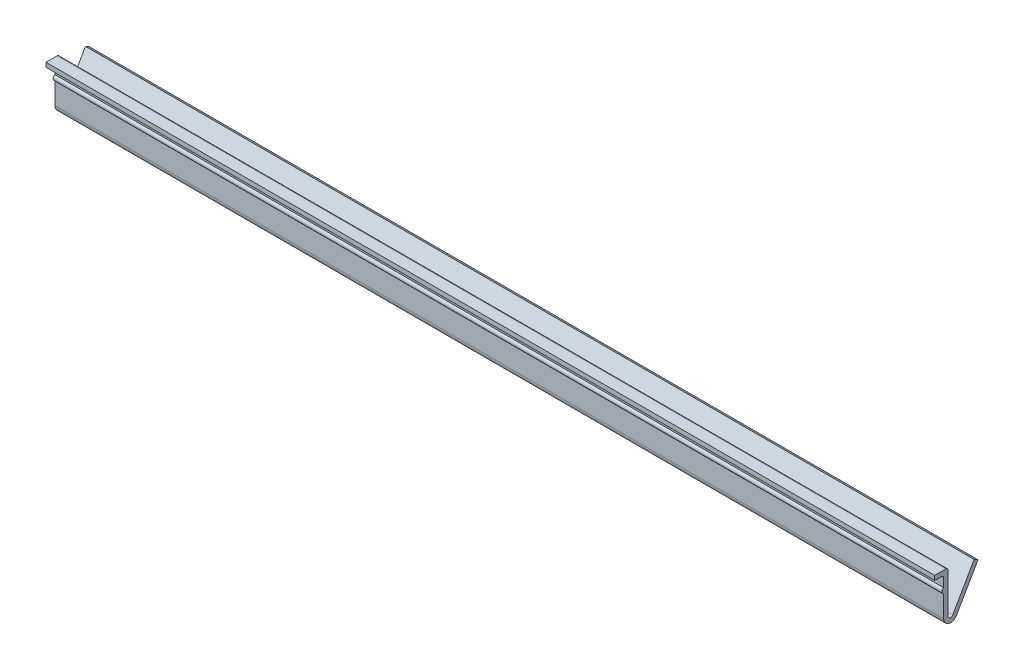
from build123d import *

# Parameters (mm, degrees)
ASENNUSLISTAT_1_6001_ASENNUSLISTA_30_1_DEPTH = 200


with BuildPart() as part:
    # Sketch1 → Asennuslistat 1.6001 ASENNUSLISTA 30_1 (new body)
    with BuildSketch(Plane(origin=(0, 0, 0), x_dir=(0, 0, -1), z_dir=(1, 0, 0))):
        with BuildLine():
            Line((-5.94354761, 6.117620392), (-3.44354761, 6.117620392))
            ThreePointArc((-3.44354761, 6.117620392), (-3.089994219, 5.971173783), (-2.94354761, 5.617620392))
            Line((-2.94354761, 5.617620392), (-2.94354761, -3.335339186))
            ThreePointArc((-2.94354761, -3.335339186), (-2.523244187, -3.882379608), (-1.886392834, -3.617184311))
            Line((-1.886392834, -3.617184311), (2.932222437, 4.77739407))
            Line((2.932222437, 4.77739407), (3.799497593, 4.279564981))
            Line((3.799497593, 4.279564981), (-1.019117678, -4.1150134))
            ThreePointArc((-1.019117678, -4.1150134), (-2.780853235, -4.84862884), (-3.94354761, -3.335339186))
            Line((-3.94354761, -3.335339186), (-3.94354761, 1.517877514))
            ThreePointArc((-3.94354761, 1.517877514), (-4.34293141, 2.117620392), (-3.94354761, 2.717363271))
            Line((-3.94354761, 2.717363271), (-3.94354761, 4.617620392))
            ThreePointArc((-3.94354761, 4.617620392), (-4.089994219, 4.971173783), (-4.44354761, 5.117620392))
            Line((-4.44354761, 5.117620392), (-5.94354761, 5.117620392))
            Line((-5.94354761, 5.117620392), (-5.94354761, 6.117620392))
        make_face()
    extrude(amount=ASENNUSLISTAT_1_6001_ASENNUSLISTA_30_1_DEPTH)


solid = part.part
